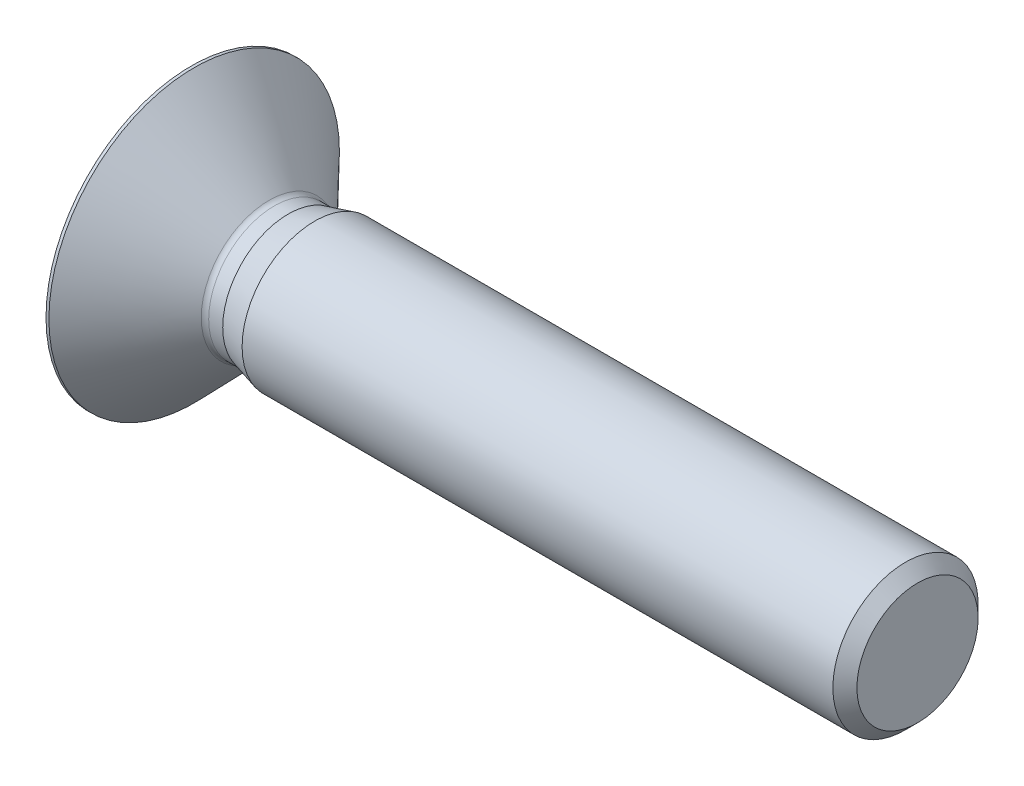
ISO-10303-21;
HEADER;
FILE_DESCRIPTION(('STEP AP214'),'2;1');
FILE_NAME('part.step','',(''),(''),'','','');
FILE_SCHEMA(('AUTOMOTIVE_DESIGN { 1 0 10303 214 1 1 1 1 }'));
ENDSEC;
DATA;
#1=APPLICATION_CONTEXT('core data for automotive mechanical design processes');
#2=APPLICATION_PROTOCOL_DEFINITION('international standard','automotive_design',2000,#1);
#3=PRODUCT_CONTEXT('',#1,'mechanical');
#4=PRODUCT('Part','Part','',(#3));
#5=PRODUCT_RELATED_PRODUCT_CATEGORY('part','',(#4));
#6=PRODUCT_DEFINITION_FORMATION('','',#4);
#7=PRODUCT_DEFINITION_CONTEXT('part definition',#1,'design');
#8=PRODUCT_DEFINITION('design','',#6,#7);
#9=PRODUCT_DEFINITION_SHAPE('','',#8);
#10=(LENGTH_UNIT() NAMED_UNIT(*) SI_UNIT(.MILLI.,.METRE.));
#11=(NAMED_UNIT(*) PLANE_ANGLE_UNIT() SI_UNIT($,.RADIAN.));
#12=(NAMED_UNIT(*) SI_UNIT($,.STERADIAN.) SOLID_ANGLE_UNIT());
#13=UNCERTAINTY_MEASURE_WITH_UNIT(LENGTH_MEASURE(1.E-05),#10,'distance_accuracy_value','');
#14=(GEOMETRIC_REPRESENTATION_CONTEXT(3) GLOBAL_UNCERTAINTY_ASSIGNED_CONTEXT((#13)) GLOBAL_UNIT_ASSIGNED_CONTEXT((#10,
#11,#12)) REPRESENTATION_CONTEXT('',''));
#15=CARTESIAN_POINT('',(0.,0.,0.));
#16=DIRECTION('',(0.,0.,1.));
#17=DIRECTION('',(1.,0.,0.));
#18=AXIS2_PLACEMENT_3D('',#15,#16,#17);
#19=CARTESIAN_POINT('',(4.4,5.19615242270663,3.));
#20=DIRECTION('',(1.,0.,0.));
#21=DIRECTION('',(0.,0.,-1.));
#22=AXIS2_PLACEMENT_3D('',#19,#20,#21);
#23=PLANE('',#22);
#24=CARTESIAN_POINT('',(4.4,0.,0.));
#25=DIRECTION('',(1.,0.,0.));
#26=DIRECTION('',(0.,0.,-1.));
#27=AXIS2_PLACEMENT_3D('',#24,#25,#26);
#28=CIRCLE('',#27,3.);
#29=CARTESIAN_POINT('',(4.4,0.,-3.));
#30=VERTEX_POINT('',#29);
#31=CARTESIAN_POINT('',(4.4,-2.59807621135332,-1.5));
#32=VERTEX_POINT('',#31);
#33=EDGE_CURVE('E11',#30,#32,#28,.F.);
#34=ORIENTED_EDGE('',*,*,#33,.F.);
#35=DIRECTION('',(0.,1.,0.));
#36=VECTOR('',#35,1.);
#37=CARTESIAN_POINT('',(4.4,-1.73205080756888,-3.));
#38=LINE('',#37,#36);
#39=CARTESIAN_POINT('',(4.4,-1.73205080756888,-3.));
#40=VERTEX_POINT('',#39);
#41=EDGE_CURVE('E200',#40,#30,#38,.T.);
#42=ORIENTED_EDGE('',*,*,#41,.F.);
#43=DIRECTION('',(0.,0.5,-0.866025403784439));
#44=VECTOR('',#43,1.);
#45=CARTESIAN_POINT('',(4.4,-3.46410161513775,0.));
#46=LINE('',#45,#44);
#47=EDGE_CURVE('E195',#32,#40,#46,.T.);
#48=ORIENTED_EDGE('',*,*,#47,.F.);
#49=EDGE_LOOP('',(#34,#42,#48));
#50=FACE_BOUND('',#49,.T.);
#51=ADVANCED_FACE('F41',(#50),#23,.F.);
#52=CARTESIAN_POINT('',(4.4,-2.59807621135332,1.5));
#53=VERTEX_POINT('',#52);
#54=EDGE_CURVE('E51',#32,#53,#28,.F.);
#55=ORIENTED_EDGE('',*,*,#54,.F.);
#56=CARTESIAN_POINT('',(4.4,-3.46410161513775,0.));
#57=VERTEX_POINT('',#56);
#58=EDGE_CURVE('E191',#57,#32,#46,.T.);
#59=ORIENTED_EDGE('',*,*,#58,.F.);
#60=DIRECTION('',(0.,-0.5,-0.866025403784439));
#61=VECTOR('',#60,1.);
#62=CARTESIAN_POINT('',(4.4,-1.73205080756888,3.));
#63=LINE('',#62,#61);
#64=EDGE_CURVE('E190',#53,#57,#63,.T.);
#65=ORIENTED_EDGE('',*,*,#64,.F.);
#66=EDGE_LOOP('',(#55,#59,#65));
#67=FACE_BOUND('',#66,.T.);
#68=ADVANCED_FACE('F128',(#67),#23,.F.);
#69=CARTESIAN_POINT('',(4.4,0.,3.));
#70=VERTEX_POINT('',#69);
#71=EDGE_CURVE('E332',#53,#70,#28,.F.);
#72=ORIENTED_EDGE('',*,*,#71,.F.);
#73=CARTESIAN_POINT('',(4.4,-1.73205080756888,3.));
#74=VERTEX_POINT('',#73);
#75=EDGE_CURVE('E189',#74,#53,#63,.T.);
#76=ORIENTED_EDGE('',*,*,#75,.F.);
#77=DIRECTION('',(0.,-1.,0.));
#78=VECTOR('',#77,1.);
#79=CARTESIAN_POINT('',(4.4,1.73205080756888,3.));
#80=LINE('',#79,#78);
#81=EDGE_CURVE('E185',#70,#74,#80,.T.);
#82=ORIENTED_EDGE('',*,*,#81,.F.);
#83=EDGE_LOOP('',(#72,#76,#82));
#84=FACE_BOUND('',#83,.T.);
#85=ADVANCED_FACE('F132',(#84),#23,.F.);
#86=CARTESIAN_POINT('',(4.4,0.,0.));
#87=DIRECTION('',(-1.,0.,0.));
#88=DIRECTION('',(0.,0.,1.));
#89=AXIS2_PLACEMENT_3D('',#86,#87,#88);
#90=CIRCLE('',#89,3.);
#91=CARTESIAN_POINT('',(4.4,2.59807621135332,1.5));
#92=VERTEX_POINT('',#91);
#93=EDGE_CURVE('E177',#70,#92,#90,.T.);
#94=ORIENTED_EDGE('',*,*,#93,.F.);
#95=CARTESIAN_POINT('',(4.4,1.73205080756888,3.));
#96=VERTEX_POINT('',#95);
#97=EDGE_CURVE('E182',#96,#70,#80,.T.);
#98=ORIENTED_EDGE('',*,*,#97,.F.);
#99=DIRECTION('',(0.,-0.5,0.866025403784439));
#100=VECTOR('',#99,1.);
#101=CARTESIAN_POINT('',(4.4,3.46410161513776,0.));
#102=LINE('',#101,#100);
#103=EDGE_CURVE('E175',#92,#96,#102,.T.);
#104=ORIENTED_EDGE('',*,*,#103,.F.);
#105=EDGE_LOOP('',(#94,#98,#104));
#106=FACE_BOUND('',#105,.T.);
#107=ADVANCED_FACE('F148',(#106),#23,.F.);
#108=CARTESIAN_POINT('',(4.4,2.59807621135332,-1.5));
#109=VERTEX_POINT('',#108);
#110=EDGE_CURVE('E59',#92,#109,#28,.F.);
#111=ORIENTED_EDGE('',*,*,#110,.F.);
#112=CARTESIAN_POINT('',(4.4,3.46410161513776,0.));
#113=VERTEX_POINT('',#112);
#114=EDGE_CURVE('E163',#113,#92,#102,.T.);
#115=ORIENTED_EDGE('',*,*,#114,.F.);
#116=DIRECTION('',(0.,0.5,0.866025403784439));
#117=VECTOR('',#116,1.);
#118=CARTESIAN_POINT('',(4.4,1.73205080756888,-3.));
#119=LINE('',#118,#117);
#120=EDGE_CURVE('E159',#109,#113,#119,.T.);
#121=ORIENTED_EDGE('',*,*,#120,.F.);
#122=EDGE_LOOP('',(#111,#115,#121));
#123=FACE_BOUND('',#122,.T.);
#124=ADVANCED_FACE('F139',(#123),#23,.F.);
#125=EDGE_CURVE('E44',#109,#30,#28,.F.);
#126=ORIENTED_EDGE('',*,*,#125,.F.);
#127=CARTESIAN_POINT('',(4.4,1.73205080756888,-3.));
#128=VERTEX_POINT('',#127);
#129=EDGE_CURVE('E155',#128,#109,#119,.T.);
#130=ORIENTED_EDGE('',*,*,#129,.F.);
#131=EDGE_CURVE('E152',#30,#128,#38,.T.);
#132=ORIENTED_EDGE('',*,*,#131,.F.);
#133=EDGE_LOOP('',(#126,#130,#132));
#134=FACE_BOUND('',#133,.T.);
#135=ADVANCED_FACE('F126',(#134),#23,.F.);
#136=CARTESIAN_POINT('',(0.,0.,0.));
#137=DIRECTION('',(1.,0.,0.));
#138=DIRECTION('',(0.,0.,-1.));
#139=AXIS2_PLACEMENT_3D('',#136,#137,#138);
#140=PLANE('',#139);
#141=CARTESIAN_POINT('',(0.,0.,0.));
#142=DIRECTION('',(-1.,0.,0.));
#143=DIRECTION('',(0.,0.,1.));
#144=AXIS2_PLACEMENT_3D('',#141,#142,#143);
#145=CIRCLE('',#144,10.);
#146=CARTESIAN_POINT('',(0.,0.,10.));
#147=VERTEX_POINT('',#146);
#148=EDGE_CURVE('E258',#147,#147,#145,.T.);
#149=ORIENTED_EDGE('',*,*,#148,.T.);
#150=EDGE_LOOP('',(#149));
#151=FACE_BOUND('',#150,.T.);
#152=DIRECTION('',(0.,0.5,0.866025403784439));
#153=VECTOR('',#152,1.);
#154=CARTESIAN_POINT('',(0.,1.73205080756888,-3.));
#155=LINE('',#154,#153);
#156=CARTESIAN_POINT('',(0.,1.73205080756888,-3.));
#157=VERTEX_POINT('',#156);
#158=CARTESIAN_POINT('',(0.,3.46410161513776,0.));
#159=VERTEX_POINT('',#158);
#160=EDGE_CURVE('E199',#157,#159,#155,.T.);
#161=ORIENTED_EDGE('',*,*,#160,.T.);
#162=DIRECTION('',(0.,-0.5,0.866025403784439));
#163=VECTOR('',#162,1.);
#164=CARTESIAN_POINT('',(0.,3.46410161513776,0.));
#165=LINE('',#164,#163);
#166=CARTESIAN_POINT('',(0.,1.73205080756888,3.));
#167=VERTEX_POINT('',#166);
#168=EDGE_CURVE('E204',#159,#167,#165,.T.);
#169=ORIENTED_EDGE('',*,*,#168,.T.);
#170=DIRECTION('',(0.,-1.,0.));
#171=VECTOR('',#170,1.);
#172=CARTESIAN_POINT('',(0.,1.73205080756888,3.));
#173=LINE('',#172,#171);
#174=CARTESIAN_POINT('',(0.,-1.73205080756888,3.));
#175=VERTEX_POINT('',#174);
#176=EDGE_CURVE('E207',#167,#175,#173,.T.);
#177=ORIENTED_EDGE('',*,*,#176,.T.);
#178=DIRECTION('',(0.,-0.5,-0.866025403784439));
#179=VECTOR('',#178,1.);
#180=CARTESIAN_POINT('',(0.,-1.73205080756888,3.));
#181=LINE('',#180,#179);
#182=CARTESIAN_POINT('',(0.,-3.46410161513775,0.));
#183=VERTEX_POINT('',#182);
#184=EDGE_CURVE('E209',#175,#183,#181,.T.);
#185=ORIENTED_EDGE('',*,*,#184,.T.);
#186=DIRECTION('',(0.,0.5,-0.866025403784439));
#187=VECTOR('',#186,1.);
#188=CARTESIAN_POINT('',(0.,-3.46410161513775,0.));
#189=LINE('',#188,#187);
#190=CARTESIAN_POINT('',(0.,-1.73205080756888,-3.));
#191=VERTEX_POINT('',#190);
#192=EDGE_CURVE('E215',#183,#191,#189,.T.);
#193=ORIENTED_EDGE('',*,*,#192,.T.);
#194=DIRECTION('',(0.,1.,0.));
#195=VECTOR('',#194,1.);
#196=CARTESIAN_POINT('',(0.,-1.73205080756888,-3.));
#197=LINE('',#196,#195);
#198=EDGE_CURVE('E66',#191,#157,#197,.T.);
#199=ORIENTED_EDGE('',*,*,#198,.T.);
#200=EDGE_LOOP('',(#161,#169,#177,#185,#193,#199));
#201=FACE_BOUND('',#200,.T.);
#202=ADVANCED_FACE('F137',(#151,#201),#140,.F.);
#203=CARTESIAN_POINT('',(0.,0.,0.));
#204=DIRECTION('',(-1.,0.,0.));
#205=DIRECTION('',(0.,0.,1.));
#206=AXIS2_PLACEMENT_3D('',#203,#204,#205);
#207=CYLINDRICAL_SURFACE('',#206,10.);
#208=ORIENTED_EDGE('',*,*,#148,.F.);
#209=EDGE_LOOP('',(#208));
#210=FACE_BOUND('',#209,.T.);
#211=CARTESIAN_POINT('',(0.199999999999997,0.,0.));
#212=DIRECTION('',(-1.,0.,0.));
#213=DIRECTION('',(0.,0.,1.));
#214=AXIS2_PLACEMENT_3D('',#211,#212,#213);
#215=CIRCLE('',#214,10.);
#216=CARTESIAN_POINT('',(0.199999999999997,0.,10.));
#217=VERTEX_POINT('',#216);
#218=EDGE_CURVE('E255',#217,#217,#215,.T.);
#219=ORIENTED_EDGE('',*,*,#218,.T.);
#220=EDGE_LOOP('',(#219));
#221=FACE_BOUND('',#220,.T.);
#222=ADVANCED_FACE('F144',(#210,#221),#207,.T.);
#223=CARTESIAN_POINT('',(5.5,0.,0.));
#224=DIRECTION('',(-1.,0.,0.));
#225=DIRECTION('',(0.,0.,1.));
#226=AXIS2_PLACEMENT_3D('',#223,#224,#225);
#227=CONICAL_SURFACE('',#226,4.51168933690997,0.802851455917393);
#228=CARTESIAN_POINT('',(5.35256750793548,0.,0.));
#229=DIRECTION('',(-1.,0.,0.));
#230=DIRECTION('',(0.,0.,1.));
#231=AXIS2_PLACEMENT_3D('',#228,#229,#230);
#232=CIRCLE('',#231,4.66436015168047);
#233=CARTESIAN_POINT('',(5.35256750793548,0.,4.66436015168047));
#234=VERTEX_POINT('',#233);
#235=EDGE_CURVE('E257',#234,#234,#232,.T.);
#236=ORIENTED_EDGE('',*,*,#235,.T.);
#237=EDGE_LOOP('',(#236));
#238=FACE_BOUND('',#237,.T.);
#239=ORIENTED_EDGE('',*,*,#218,.F.);
#240=EDGE_LOOP('',(#239));
#241=FACE_BOUND('',#240,.T.);
#242=ADVANCED_FACE('F273',(#238,#241),#227,.T.);
#243=CARTESIAN_POINT('',(0.,0.,0.));
#244=DIRECTION('',(-1.,0.,0.));
#245=DIRECTION('',(0.,0.,1.));
#246=AXIS2_PLACEMENT_3D('',#243,#244,#245);
#247=CYLINDRICAL_SURFACE('',#246,4.51168933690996);
#248=CARTESIAN_POINT('',(5.7122374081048,0.,0.));
#249=DIRECTION('',(-1.,0.,0.));
#250=DIRECTION('',(0.,0.,1.));
#251=AXIS2_PLACEMENT_3D('',#248,#249,#250);
#252=CIRCLE('',#251,4.51168933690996);
#253=CARTESIAN_POINT('',(5.7122374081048,0.,4.51168933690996));
#254=VERTEX_POINT('',#253);
#255=EDGE_CURVE('E156',#254,#254,#252,.F.);
#256=ORIENTED_EDGE('',*,*,#255,.T.);
#257=EDGE_LOOP('',(#256));
#258=FACE_BOUND('',#257,.T.);
#259=CARTESIAN_POINT('',(6.67759979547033,0.,0.));
#260=DIRECTION('',(-1.,0.,0.));
#261=DIRECTION('',(0.,0.,1.));
#262=AXIS2_PLACEMENT_3D('',#259,#260,#261);
#263=CIRCLE('',#262,4.51168933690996);
#264=CARTESIAN_POINT('',(6.67759979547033,0.,4.51168933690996));
#265=VERTEX_POINT('',#264);
#266=EDGE_CURVE('E247',#265,#265,#263,.T.);
#267=ORIENTED_EDGE('',*,*,#266,.T.);
#268=EDGE_LOOP('',(#267));
#269=FACE_BOUND('',#268,.T.);
#270=ADVANCED_FACE('F269',(#258,#269),#247,.T.);
#271=CARTESIAN_POINT('',(8.5,0.,0.));
#272=DIRECTION('',(1.,0.,0.));
#273=DIRECTION('',(0.,0.,-1.));
#274=AXIS2_PLACEMENT_3D('',#271,#272,#273);
#275=CONICAL_SURFACE('',#274,5.,0.26179938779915);
#276=ORIENTED_EDGE('',*,*,#266,.F.);
#277=EDGE_LOOP('',(#276));
#278=FACE_BOUND('',#277,.T.);
#279=CARTESIAN_POINT('',(8.5,0.,0.));
#280=DIRECTION('',(-1.,0.,0.));
#281=DIRECTION('',(0.,0.,1.));
#282=AXIS2_PLACEMENT_3D('',#279,#280,#281);
#283=CIRCLE('',#282,5.);
#284=CARTESIAN_POINT('',(8.5,0.,5.));
#285=VERTEX_POINT('',#284);
#286=EDGE_CURVE('E242',#285,#285,#283,.T.);
#287=ORIENTED_EDGE('',*,*,#286,.T.);
#288=EDGE_LOOP('',(#287));
#289=FACE_BOUND('',#288,.T.);
#290=ADVANCED_FACE('F293',(#278,#289),#275,.T.);
#291=CARTESIAN_POINT('',(0.,0.,0.));
#292=DIRECTION('',(-1.,0.,0.));
#293=DIRECTION('',(0.,0.,1.));
#294=AXIS2_PLACEMENT_3D('',#291,#292,#293);
#295=CYLINDRICAL_SURFACE('',#294,5.);
#296=ORIENTED_EDGE('',*,*,#286,.F.);
#297=EDGE_LOOP('',(#296));
#298=FACE_BOUND('',#297,.T.);
#299=CARTESIAN_POINT('',(49.172,0.,0.));
#300=DIRECTION('',(-1.,0.,0.));
#301=DIRECTION('',(0.,0.,1.));
#302=AXIS2_PLACEMENT_3D('',#299,#300,#301);
#303=CIRCLE('',#302,5.);
#304=CARTESIAN_POINT('',(49.172,0.,5.));
#305=VERTEX_POINT('',#304);
#306=EDGE_CURVE('E239',#305,#305,#303,.T.);
#307=ORIENTED_EDGE('',*,*,#306,.T.);
#308=EDGE_LOOP('',(#307));
#309=FACE_BOUND('',#308,.T.);
#310=ADVANCED_FACE('F291',(#298,#309),#295,.T.);
#311=CARTESIAN_POINT('',(50.,0.,0.));
#312=DIRECTION('',(-1.,0.,0.));
#313=DIRECTION('',(0.,0.,1.));
#314=AXIS2_PLACEMENT_3D('',#311,#312,#313);
#315=CONICAL_SURFACE('',#314,4.17199999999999,0.78539816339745);
#316=ORIENTED_EDGE('',*,*,#306,.F.);
#317=EDGE_LOOP('',(#316));
#318=FACE_BOUND('',#317,.T.);
#319=CARTESIAN_POINT('',(50.,0.,0.));
#320=DIRECTION('',(-1.,0.,0.));
#321=DIRECTION('',(0.,0.,1.));
#322=AXIS2_PLACEMENT_3D('',#319,#320,#321);
#323=CIRCLE('',#322,4.17199999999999);
#324=CARTESIAN_POINT('',(50.,0.,4.17199999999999));
#325=VERTEX_POINT('',#324);
#326=EDGE_CURVE('E236',#325,#325,#323,.T.);
#327=ORIENTED_EDGE('',*,*,#326,.T.);
#328=EDGE_LOOP('',(#327));
#329=FACE_BOUND('',#328,.T.);
#330=ADVANCED_FACE('F300',(#318,#329),#315,.T.);
#331=CARTESIAN_POINT('',(50.,4.17199999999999,0.));
#332=DIRECTION('',(-1.,0.,0.));
#333=DIRECTION('',(0.,0.,1.));
#334=AXIS2_PLACEMENT_3D('',#331,#332,#333);
#335=PLANE('',#334);
#336=ORIENTED_EDGE('',*,*,#326,.F.);
#337=EDGE_LOOP('',(#336));
#338=FACE_BOUND('',#337,.T.);
#339=ADVANCED_FACE('F275',(#338),#335,.F.);
#340=CARTESIAN_POINT('',(5.7122374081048,0.,0.));
#341=DIRECTION('',(-1.,0.,0.));
#342=DIRECTION('',(0.,0.,1.));
#343=AXIS2_PLACEMENT_3D('',#340,#341,#342);
#344=TOROIDAL_SURFACE('',#343,5.01168933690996,0.5);
#345=ORIENTED_EDGE('',*,*,#255,.F.);
#346=EDGE_LOOP('',(#345));
#347=FACE_BOUND('',#346,.T.);
#348=ORIENTED_EDGE('',*,*,#235,.F.);
#349=EDGE_LOOP('',(#348));
#350=FACE_BOUND('',#349,.T.);
#351=ADVANCED_FACE('F43',(#347,#350),#344,.F.);
#352=CARTESIAN_POINT('',(4.4,1.73205080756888,-3.));
#353=DIRECTION('',(0.,-0.866025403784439,0.5));
#354=DIRECTION('',(0.,-0.5,-0.866025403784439));
#355=AXIS2_PLACEMENT_3D('',#352,#353,#354);
#356=PLANE('',#355);
#357=ORIENTED_EDGE('',*,*,#129,.T.);
#358=ORIENTED_EDGE('',*,*,#120,.T.);
#359=DIRECTION('',(-1.,0.,0.));
#360=VECTOR('',#359,1.);
#361=CARTESIAN_POINT('',(4.4,3.46410161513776,0.));
#362=LINE('',#361,#360);
#363=EDGE_CURVE('E234',#113,#159,#362,.T.);
#364=ORIENTED_EDGE('',*,*,#363,.T.);
#365=ORIENTED_EDGE('',*,*,#160,.F.);
#366=DIRECTION('',(-1.,0.,0.));
#367=VECTOR('',#366,1.);
#368=CARTESIAN_POINT('',(4.4,1.73205080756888,-3.));
#369=LINE('',#368,#367);
#370=EDGE_CURVE('E167',#128,#157,#369,.T.);
#371=ORIENTED_EDGE('',*,*,#370,.F.);
#372=EDGE_LOOP('',(#357,#358,#364,#365,#371));
#373=FACE_BOUND('',#372,.T.);
#374=ADVANCED_FACE('F166',(#373),#356,.T.);
#375=CARTESIAN_POINT('',(4.4,3.46410161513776,0.));
#376=DIRECTION('',(0.,-0.866025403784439,-0.5));
#377=DIRECTION('',(0.,0.5,-0.866025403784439));
#378=AXIS2_PLACEMENT_3D('',#375,#376,#377);
#379=PLANE('',#378);
#380=ORIENTED_EDGE('',*,*,#114,.T.);
#381=ORIENTED_EDGE('',*,*,#103,.T.);
#382=DIRECTION('',(-1.,0.,0.));
#383=VECTOR('',#382,1.);
#384=CARTESIAN_POINT('',(4.4,1.73205080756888,3.));
#385=LINE('',#384,#383);
#386=EDGE_CURVE('E229',#96,#167,#385,.T.);
#387=ORIENTED_EDGE('',*,*,#386,.T.);
#388=ORIENTED_EDGE('',*,*,#168,.F.);
#389=ORIENTED_EDGE('',*,*,#363,.F.);
#390=EDGE_LOOP('',(#380,#381,#387,#388,#389));
#391=FACE_BOUND('',#390,.T.);
#392=ADVANCED_FACE('F310',(#391),#379,.T.);
#393=CARTESIAN_POINT('',(4.4,1.73205080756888,3.));
#394=DIRECTION('',(0.,0.,-1.));
#395=DIRECTION('',(-1.,0.,0.));
#396=AXIS2_PLACEMENT_3D('',#393,#394,#395);
#397=PLANE('',#396);
#398=ORIENTED_EDGE('',*,*,#97,.T.);
#399=ORIENTED_EDGE('',*,*,#81,.T.);
#400=DIRECTION('',(-1.,0.,0.));
#401=VECTOR('',#400,1.);
#402=CARTESIAN_POINT('',(4.4,-1.73205080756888,3.));
#403=LINE('',#402,#401);
#404=EDGE_CURVE('E228',#74,#175,#403,.T.);
#405=ORIENTED_EDGE('',*,*,#404,.T.);
#406=ORIENTED_EDGE('',*,*,#176,.F.);
#407=ORIENTED_EDGE('',*,*,#386,.F.);
#408=EDGE_LOOP('',(#398,#399,#405,#406,#407));
#409=FACE_BOUND('',#408,.T.);
#410=ADVANCED_FACE('F309',(#409),#397,.T.);
#411=CARTESIAN_POINT('',(4.4,-1.73205080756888,3.));
#412=DIRECTION('',(0.,0.866025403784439,-0.5));
#413=DIRECTION('',(0.,0.5,0.866025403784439));
#414=AXIS2_PLACEMENT_3D('',#411,#412,#413);
#415=PLANE('',#414);
#416=ORIENTED_EDGE('',*,*,#75,.T.);
#417=ORIENTED_EDGE('',*,*,#64,.T.);
#418=DIRECTION('',(-1.,0.,0.));
#419=VECTOR('',#418,1.);
#420=CARTESIAN_POINT('',(4.4,-3.46410161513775,0.));
#421=LINE('',#420,#419);
#422=EDGE_CURVE('E222',#57,#183,#421,.T.);
#423=ORIENTED_EDGE('',*,*,#422,.T.);
#424=ORIENTED_EDGE('',*,*,#184,.F.);
#425=ORIENTED_EDGE('',*,*,#404,.F.);
#426=EDGE_LOOP('',(#416,#417,#423,#424,#425));
#427=FACE_BOUND('',#426,.T.);
#428=ADVANCED_FACE('F313',(#427),#415,.T.);
#429=CARTESIAN_POINT('',(4.4,-3.46410161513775,0.));
#430=DIRECTION('',(0.,0.866025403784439,0.5));
#431=DIRECTION('',(0.,-0.5,0.866025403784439));
#432=AXIS2_PLACEMENT_3D('',#429,#430,#431);
#433=PLANE('',#432);
#434=ORIENTED_EDGE('',*,*,#58,.T.);
#435=ORIENTED_EDGE('',*,*,#47,.T.);
#436=DIRECTION('',(-1.,0.,0.));
#437=VECTOR('',#436,1.);
#438=CARTESIAN_POINT('',(4.4,-1.73205080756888,-3.));
#439=LINE('',#438,#437);
#440=EDGE_CURVE('E217',#40,#191,#439,.T.);
#441=ORIENTED_EDGE('',*,*,#440,.T.);
#442=ORIENTED_EDGE('',*,*,#192,.F.);
#443=ORIENTED_EDGE('',*,*,#422,.F.);
#444=EDGE_LOOP('',(#434,#435,#441,#442,#443));
#445=FACE_BOUND('',#444,.T.);
#446=ADVANCED_FACE('F122',(#445),#433,.T.);
#447=CARTESIAN_POINT('',(4.4,-1.73205080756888,-3.));
#448=DIRECTION('',(0.,0.,1.));
#449=DIRECTION('',(1.,0.,0.));
#450=AXIS2_PLACEMENT_3D('',#447,#448,#449);
#451=PLANE('',#450);
#452=ORIENTED_EDGE('',*,*,#41,.T.);
#453=ORIENTED_EDGE('',*,*,#131,.T.);
#454=ORIENTED_EDGE('',*,*,#370,.T.);
#455=ORIENTED_EDGE('',*,*,#198,.F.);
#456=ORIENTED_EDGE('',*,*,#440,.F.);
#457=EDGE_LOOP('',(#452,#453,#454,#455,#456));
#458=FACE_BOUND('',#457,.T.);
#459=ADVANCED_FACE('F116',(#458),#451,.T.);
#460=CARTESIAN_POINT('',(6.1320508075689,0.,0.));
#461=DIRECTION('',(-1.,0.,0.));
#462=DIRECTION('',(0.,0.,1.));
#463=AXIS2_PLACEMENT_3D('',#460,#461,#462);
#464=CONICAL_SURFACE('',#463,0.,1.04719755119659);
#465=ORIENTED_EDGE('',*,*,#93,.T.);
#466=ORIENTED_EDGE('',*,*,#110,.T.);
#467=ORIENTED_EDGE('',*,*,#125,.T.);
#468=ORIENTED_EDGE('',*,*,#33,.T.);
#469=ORIENTED_EDGE('',*,*,#54,.T.);
#470=ORIENTED_EDGE('',*,*,#71,.T.);
#471=EDGE_LOOP('',(#465,#466,#467,#468,#469,#470));
#472=FACE_BOUND('',#471,.T.);
#473=CARTESIAN_POINT('',(6.1320508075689,0.,0.));
#474=VERTEX_POINT('',#473);
#475=VERTEX_LOOP('',#474);
#476=FACE_BOUND('',#475,.T.);
#477=ADVANCED_FACE('F112',(#472,#476),#464,.F.);
#478=CLOSED_SHELL('',(#51,#68,#85,#107,#124,#135,#202,#222,#242,#270,#290,#310,#330,#339,#351,
#374,#392,#410,#428,#446,#459,#477));
#479=MANIFOLD_SOLID_BREP('B2',#478);
#480=ADVANCED_BREP_SHAPE_REPRESENTATION('',(#18,#479),#14);
#481=SHAPE_DEFINITION_REPRESENTATION(#9,#480);
ENDSEC;
END-ISO-10303-21;
